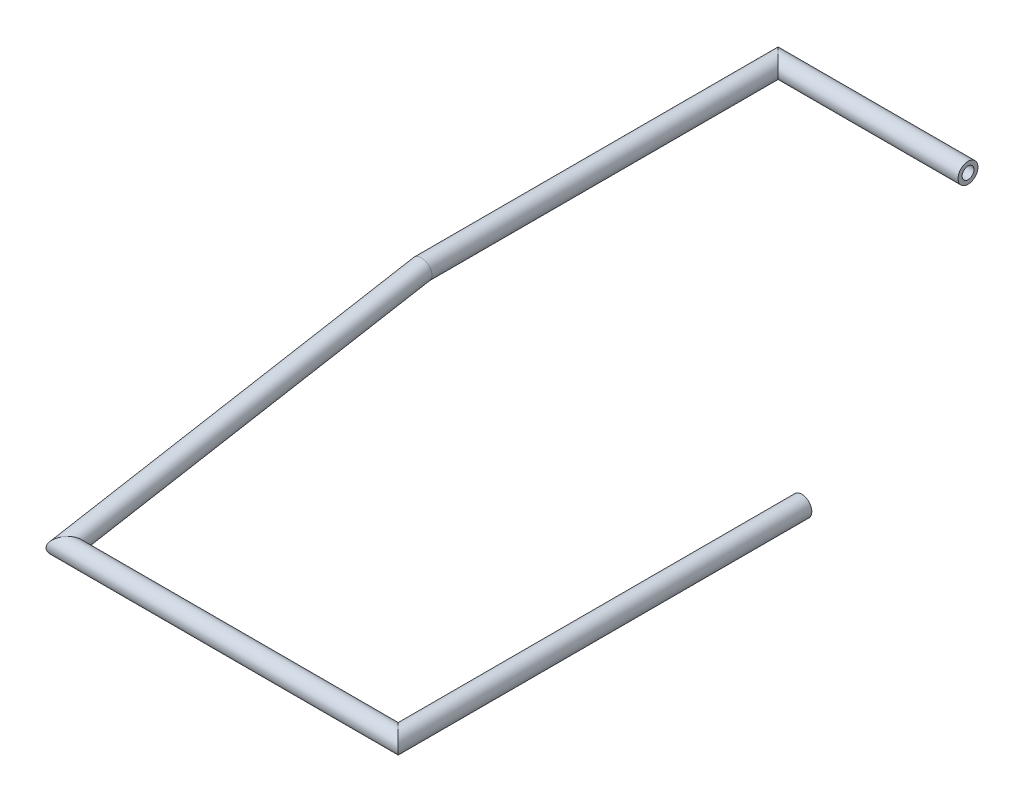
ISO-10303-21;
HEADER;
FILE_DESCRIPTION(('STEP AP214'),'2;1');
FILE_NAME('part.step','',(''),(''),'','','');
FILE_SCHEMA(('AUTOMOTIVE_DESIGN { 1 0 10303 214 1 1 1 1 }'));
ENDSEC;
DATA;
#1=APPLICATION_CONTEXT('core data for automotive mechanical design processes');
#2=APPLICATION_PROTOCOL_DEFINITION('international standard','automotive_design',2000,#1);
#3=PRODUCT_CONTEXT('',#1,'mechanical');
#4=PRODUCT('Part','Part','',(#3));
#5=PRODUCT_RELATED_PRODUCT_CATEGORY('part','',(#4));
#6=PRODUCT_DEFINITION_FORMATION('','',#4);
#7=PRODUCT_DEFINITION_CONTEXT('part definition',#1,'design');
#8=PRODUCT_DEFINITION('design','',#6,#7);
#9=PRODUCT_DEFINITION_SHAPE('','',#8);
#10=(LENGTH_UNIT() NAMED_UNIT(*) SI_UNIT(.MILLI.,.METRE.));
#11=(NAMED_UNIT(*) PLANE_ANGLE_UNIT() SI_UNIT($,.RADIAN.));
#12=(NAMED_UNIT(*) SI_UNIT($,.STERADIAN.) SOLID_ANGLE_UNIT());
#13=UNCERTAINTY_MEASURE_WITH_UNIT(LENGTH_MEASURE(1.E-05),#10,'distance_accuracy_value','');
#14=(GEOMETRIC_REPRESENTATION_CONTEXT(3) GLOBAL_UNCERTAINTY_ASSIGNED_CONTEXT((#13)) GLOBAL_UNIT_ASSIGNED_CONTEXT((#10,
#11,#12)) REPRESENTATION_CONTEXT('',''));
#15=CARTESIAN_POINT('',(0.,0.,0.));
#16=DIRECTION('',(0.,0.,1.));
#17=DIRECTION('',(1.,0.,0.));
#18=AXIS2_PLACEMENT_3D('',#15,#16,#17);
#19=CARTESIAN_POINT('',(-371.331975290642,2233.04562277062,-330.200000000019));
#20=DIRECTION('',(1.,0.,0.));
#21=DIRECTION('',(0.,0.,-1.));
#22=AXIS2_PLACEMENT_3D('',#19,#20,#21);
#23=CYLINDRICAL_SURFACE('',#22,10.668);
#24=CARTESIAN_POINT('',(-355.600000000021,2233.04562277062,-330.200000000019));
#25=DIRECTION('',(0.707106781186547,0.,-0.707106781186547));
#26=DIRECTION('',(-0.707106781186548,0.,-0.707106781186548));
#27=AXIS2_PLACEMENT_3D('',#24,#25,#26);
#28=ELLIPSE('',#27,15.0868302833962,10.668);
#29=CARTESIAN_POINT('',(-366.268000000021,2233.04562277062,-340.868000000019));
#30=VERTEX_POINT('',#29);
#31=EDGE_CURVE('E34',#30,#30,#28,.F.);
#32=ORIENTED_EDGE('',*,*,#31,.F.);
#33=EDGE_LOOP('',(#32));
#34=FACE_BOUND('',#33,.T.);
#35=CARTESIAN_POINT('',(-152.400000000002,2233.04562277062,-330.200000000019));
#36=DIRECTION('',(1.,0.,0.));
#37=DIRECTION('',(0.,0.173648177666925,-0.984807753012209));
#38=AXIS2_PLACEMENT_3D('',#35,#36,#37);
#39=CIRCLE('',#38,10.668);
#40=CARTESIAN_POINT('',(-152.400000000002,2234.89810152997,-340.705929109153));
#41=VERTEX_POINT('',#40);
#42=EDGE_CURVE('E60',#41,#41,#39,.T.);
#43=ORIENTED_EDGE('',*,*,#42,.F.);
#44=EDGE_LOOP('',(#43));
#45=FACE_BOUND('',#44,.T.);
#46=ADVANCED_FACE('F31',(#34,#45),#23,.T.);
#47=CARTESIAN_POINT('',(-355.600000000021,2233.04562277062,53.1004073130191));
#48=DIRECTION('',(0.,0.,-1.));
#49=DIRECTION('',(0.,1.,0.));
#50=AXIS2_PLACEMENT_3D('',#47,#48,#49);
#51=CYLINDRICAL_SURFACE('',#50,10.668);
#52=CARTESIAN_POINT('',(-355.600000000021,2233.04562277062,50.7999999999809));
#53=DIRECTION('',(0.,0.0871557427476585,-0.996194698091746));
#54=DIRECTION('',(0.,0.996194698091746,0.0871557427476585));
#55=AXIS2_PLACEMENT_3D('',#52,#53,#54);
#56=ELLIPSE('',#55,10.7087500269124,10.668);
#57=CARTESIAN_POINT('',(-355.600000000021,2243.71362277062,51.7333290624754));
#58=VERTEX_POINT('',#57);
#59=EDGE_CURVE('E68',#58,#58,#56,.F.);
#60=ORIENTED_EDGE('',*,*,#59,.F.);
#61=EDGE_LOOP('',(#60));
#62=FACE_BOUND('',#61,.T.);
#63=ORIENTED_EDGE('',*,*,#31,.T.);
#64=EDGE_LOOP('',(#63));
#65=FACE_BOUND('',#64,.T.);
#66=ADVANCED_FACE('F75',(#62,#65),#51,.T.);
#67=CARTESIAN_POINT('',(-355.600000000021,2163.13321428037,447.292971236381));
#68=DIRECTION('',(0.,0.173648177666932,-0.984807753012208));
#69=DIRECTION('',(0.,0.984807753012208,0.173648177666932));
#70=AXIS2_PLACEMENT_3D('',#67,#68,#69);
#71=CYLINDRICAL_SURFACE('',#70,10.668);
#72=CARTESIAN_POINT('',(-355.600000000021,2165.86504312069,431.799999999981));
#73=DIRECTION('',(-0.707106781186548,0.122787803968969,-0.696364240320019));
#74=DIRECTION('',(-0.707106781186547,-0.122787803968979,0.696364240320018));
#75=AXIS2_PLACEMENT_3D('',#72,#73,#74);
#76=ELLIPSE('',#75,15.0868302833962,10.668);
#77=CARTESIAN_POINT('',(-366.268000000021,2164.01256436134,442.305929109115));
#78=VERTEX_POINT('',#77);
#79=EDGE_CURVE('E66',#78,#78,#76,.F.);
#80=ORIENTED_EDGE('',*,*,#79,.F.);
#81=EDGE_LOOP('',(#80));
#82=FACE_BOUND('',#81,.T.);
#83=ORIENTED_EDGE('',*,*,#59,.T.);
#84=EDGE_LOOP('',(#83));
#85=FACE_BOUND('',#84,.T.);
#86=ADVANCED_FACE('F171',(#82,#85),#71,.T.);
#87=CARTESIAN_POINT('',(11.8347999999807,2165.86504312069,431.799999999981));
#88=DIRECTION('',(-1.,0.,0.));
#89=DIRECTION('',(0.,-1.,0.));
#90=AXIS2_PLACEMENT_3D('',#87,#88,#89);
#91=CYLINDRICAL_SURFACE('',#90,10.668);
#92=CARTESIAN_POINT('',(-2.12911573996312E-11,2165.86504312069,431.799999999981));
#93=DIRECTION('',(-0.707106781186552,0.,0.707106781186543));
#94=DIRECTION('',(0.707106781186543,0.,0.707106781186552));
#95=AXIS2_PLACEMENT_3D('',#92,#93,#94);
#96=ELLIPSE('',#95,15.0868302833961,10.668);
#97=CARTESIAN_POINT('',(10.6679999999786,2165.86504312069,442.467999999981));
#98=VERTEX_POINT('',#97);
#99=EDGE_CURVE('E63',#98,#98,#96,.F.);
#100=ORIENTED_EDGE('',*,*,#99,.F.);
#101=EDGE_LOOP('',(#100));
#102=FACE_BOUND('',#101,.T.);
#103=ORIENTED_EDGE('',*,*,#79,.T.);
#104=EDGE_LOOP('',(#103));
#105=FACE_BOUND('',#104,.T.);
#106=ADVANCED_FACE('F94',(#102,#105),#91,.T.);
#107=CARTESIAN_POINT('',(-1.6153745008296E-11,2165.86504312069,0.));
#108=DIRECTION('',(0.,0.,1.));
#109=DIRECTION('',(1.,0.,0.));
#110=AXIS2_PLACEMENT_3D('',#107,#108,#109);
#111=CYLINDRICAL_SURFACE('',#110,10.668);
#112=CARTESIAN_POINT('',(-1.6153745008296E-11,2165.86504312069,0.));
#113=DIRECTION('',(0.,0.,1.));
#114=DIRECTION('',(1.,0.,0.));
#115=AXIS2_PLACEMENT_3D('',#112,#113,#114);
#116=CIRCLE('',#115,10.668);
#117=CARTESIAN_POINT('',(10.6679999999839,2165.86504312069,0.));
#118=VERTEX_POINT('',#117);
#119=EDGE_CURVE('E57',#118,#118,#116,.T.);
#120=ORIENTED_EDGE('',*,*,#119,.T.);
#121=EDGE_LOOP('',(#120));
#122=FACE_BOUND('',#121,.T.);
#123=ORIENTED_EDGE('',*,*,#99,.T.);
#124=EDGE_LOOP('',(#123));
#125=FACE_BOUND('',#124,.T.);
#126=ADVANCED_FACE('F84',(#122,#125),#111,.T.);
#127=CARTESIAN_POINT('',(-152.400000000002,2233.04562277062,-330.200000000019));
#128=DIRECTION('',(1.,0.,0.));
#129=DIRECTION('',(0.,0.173648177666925,-0.984807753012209));
#130=AXIS2_PLACEMENT_3D('',#127,#128,#129);
#131=PLANE('',#130);
#132=CARTESIAN_POINT('',(-152.400000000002,2233.04562277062,-330.200000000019));
#133=DIRECTION('',(1.,0.,0.));
#134=DIRECTION('',(0.,0.173648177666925,-0.984807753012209));
#135=AXIS2_PLACEMENT_3D('',#132,#133,#134);
#136=CIRCLE('',#135,6.35000000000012);
#137=CARTESIAN_POINT('',(-152.400000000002,2234.1482886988,-336.453529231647));
#138=VERTEX_POINT('',#137);
#139=EDGE_CURVE('E54',#138,#138,#136,.F.);
#140=ORIENTED_EDGE('',*,*,#139,.T.);
#141=EDGE_LOOP('',(#140));
#142=FACE_BOUND('',#141,.T.);
#143=ORIENTED_EDGE('',*,*,#42,.T.);
#144=EDGE_LOOP('',(#143));
#145=FACE_BOUND('',#144,.T.);
#146=ADVANCED_FACE('F81',(#142,#145),#131,.T.);
#147=CARTESIAN_POINT('',(-1.6153745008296E-11,2165.86504312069,0.));
#148=DIRECTION('',(0.,0.,1.));
#149=DIRECTION('',(1.,0.,0.));
#150=AXIS2_PLACEMENT_3D('',#147,#148,#149);
#151=PLANE('',#150);
#152=CARTESIAN_POINT('',(-1.6153745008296E-11,2165.86504312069,0.));
#153=DIRECTION('',(0.,0.,1.));
#154=DIRECTION('',(1.,0.,0.));
#155=AXIS2_PLACEMENT_3D('',#152,#153,#154);
#156=CIRCLE('',#155,6.35000000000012);
#157=CARTESIAN_POINT('',(6.34999999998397,2165.86504312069,0.));
#158=VERTEX_POINT('',#157);
#159=EDGE_CURVE('E38',#158,#158,#156,.F.);
#160=ORIENTED_EDGE('',*,*,#159,.F.);
#161=EDGE_LOOP('',(#160));
#162=FACE_BOUND('',#161,.T.);
#163=ORIENTED_EDGE('',*,*,#119,.F.);
#164=EDGE_LOOP('',(#163));
#165=FACE_BOUND('',#164,.T.);
#166=ADVANCED_FACE('F83',(#162,#165),#151,.F.);
#167=CARTESIAN_POINT('',(-365.00474719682,2233.04562277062,-330.200000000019));
#168=DIRECTION('',(1.,0.,0.));
#169=DIRECTION('',(0.,0.,-1.));
#170=AXIS2_PLACEMENT_3D('',#167,#168,#169);
#171=CYLINDRICAL_SURFACE('',#170,6.35000000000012);
#172=CARTESIAN_POINT('',(-355.600000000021,2233.04562277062,-330.200000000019));
#173=DIRECTION('',(0.707106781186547,0.,-0.707106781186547));
#174=DIRECTION('',(-0.707106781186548,0.,-0.707106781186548));
#175=AXIS2_PLACEMENT_3D('',#172,#173,#174);
#176=ELLIPSE('',#175,8.98025612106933,6.35000000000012);
#177=CARTESIAN_POINT('',(-361.950000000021,2233.04562277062,-336.55000000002));
#178=VERTEX_POINT('',#177);
#179=EDGE_CURVE('E51',#178,#178,#176,.T.);
#180=ORIENTED_EDGE('',*,*,#179,.F.);
#181=EDGE_LOOP('',(#180));
#182=FACE_BOUND('',#181,.T.);
#183=ORIENTED_EDGE('',*,*,#139,.F.);
#184=EDGE_LOOP('',(#183));
#185=FACE_BOUND('',#184,.T.);
#186=ADVANCED_FACE('F91',(#182,#185),#171,.F.);
#187=CARTESIAN_POINT('',(-355.600000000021,2233.04562277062,52.2097662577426));
#188=DIRECTION('',(0.,0.,-1.));
#189=DIRECTION('',(0.,1.,0.));
#190=AXIS2_PLACEMENT_3D('',#187,#188,#189);
#191=CYLINDRICAL_SURFACE('',#190,6.35000000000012);
#192=CARTESIAN_POINT('',(-355.600000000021,2233.04562277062,50.7999999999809));
#193=DIRECTION('',(0.,0.0871557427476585,-0.996194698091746));
#194=DIRECTION('',(0.,0.996194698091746,0.0871557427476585));
#195=AXIS2_PLACEMENT_3D('',#192,#193,#194);
#196=ELLIPSE('',#195,6.37425596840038,6.35000000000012);
#197=CARTESIAN_POINT('',(-355.600000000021,2239.39562277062,51.3555530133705));
#198=VERTEX_POINT('',#197);
#199=EDGE_CURVE('E48',#198,#198,#196,.T.);
#200=ORIENTED_EDGE('',*,*,#199,.F.);
#201=EDGE_LOOP('',(#200));
#202=FACE_BOUND('',#201,.T.);
#203=ORIENTED_EDGE('',*,*,#179,.T.);
#204=EDGE_LOOP('',(#203));
#205=FACE_BOUND('',#204,.T.);
#206=ADVANCED_FACE('F111',(#202,#205),#191,.F.);
#207=CARTESIAN_POINT('',(-355.600000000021,2164.23192590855,441.061867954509));
#208=DIRECTION('',(0.,0.173648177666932,-0.984807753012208));
#209=DIRECTION('',(0.,0.984807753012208,0.173648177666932));
#210=AXIS2_PLACEMENT_3D('',#207,#208,#209);
#211=CYLINDRICAL_SURFACE('',#210,6.35000000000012);
#212=CARTESIAN_POINT('',(-355.600000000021,2165.86504312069,431.799999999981));
#213=DIRECTION('',(-0.707106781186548,0.122787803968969,-0.696364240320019));
#214=DIRECTION('',(-0.707106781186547,-0.122787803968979,0.696364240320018));
#215=AXIS2_PLACEMENT_3D('',#212,#213,#214);
#216=ELLIPSE('',#215,8.98025612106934,6.35000000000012);
#217=CARTESIAN_POINT('',(-361.950000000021,2164.7623771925,438.053529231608));
#218=VERTEX_POINT('',#217);
#219=EDGE_CURVE('E43',#218,#218,#216,.T.);
#220=ORIENTED_EDGE('',*,*,#219,.F.);
#221=EDGE_LOOP('',(#220));
#222=FACE_BOUND('',#221,.T.);
#223=ORIENTED_EDGE('',*,*,#199,.T.);
#224=EDGE_LOOP('',(#223));
#225=FACE_BOUND('',#224,.T.);
#226=ADVANCED_FACE('F105',(#222,#225),#211,.F.);
#227=CARTESIAN_POINT('',(7.08499999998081,2165.86504312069,431.799999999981));
#228=DIRECTION('',(-1.,0.,0.));
#229=DIRECTION('',(0.,-1.,0.));
#230=AXIS2_PLACEMENT_3D('',#227,#228,#229);
#231=CYLINDRICAL_SURFACE('',#230,6.35000000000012);
#232=CARTESIAN_POINT('',(-2.12911573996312E-11,2165.86504312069,431.799999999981));
#233=DIRECTION('',(-0.707106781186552,0.,0.707106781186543));
#234=DIRECTION('',(0.707106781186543,0.,0.707106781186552));
#235=AXIS2_PLACEMENT_3D('',#232,#233,#234);
#236=ELLIPSE('',#235,8.98025612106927,6.35000000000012);
#237=CARTESIAN_POINT('',(6.34999999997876,2165.86504312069,438.149999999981));
#238=VERTEX_POINT('',#237);
#239=EDGE_CURVE('E10',#238,#238,#236,.T.);
#240=ORIENTED_EDGE('',*,*,#239,.F.);
#241=EDGE_LOOP('',(#240));
#242=FACE_BOUND('',#241,.T.);
#243=ORIENTED_EDGE('',*,*,#219,.T.);
#244=EDGE_LOOP('',(#243));
#245=FACE_BOUND('',#244,.T.);
#246=ADVANCED_FACE('F99',(#242,#245),#231,.F.);
#247=CARTESIAN_POINT('',(-1.6153745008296E-11,2165.86504312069,0.));
#248=DIRECTION('',(0.,0.,1.));
#249=DIRECTION('',(1.,0.,0.));
#250=AXIS2_PLACEMENT_3D('',#247,#248,#249);
#251=CYLINDRICAL_SURFACE('',#250,6.35000000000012);
#252=ORIENTED_EDGE('',*,*,#159,.T.);
#253=EDGE_LOOP('',(#252));
#254=FACE_BOUND('',#253,.T.);
#255=ORIENTED_EDGE('',*,*,#239,.T.);
#256=EDGE_LOOP('',(#255));
#257=FACE_BOUND('',#256,.T.);
#258=ADVANCED_FACE('F97',(#254,#257),#251,.F.);
#259=CLOSED_SHELL('',(#46,#66,#86,#106,#126,#146,#166,#186,#206,#226,#246,#258));
#260=MANIFOLD_SOLID_BREP('B2',#259);
#261=ADVANCED_BREP_SHAPE_REPRESENTATION('',(#18,#260),#14);
#262=SHAPE_DEFINITION_REPRESENTATION(#9,#261);
ENDSEC;
END-ISO-10303-21;
